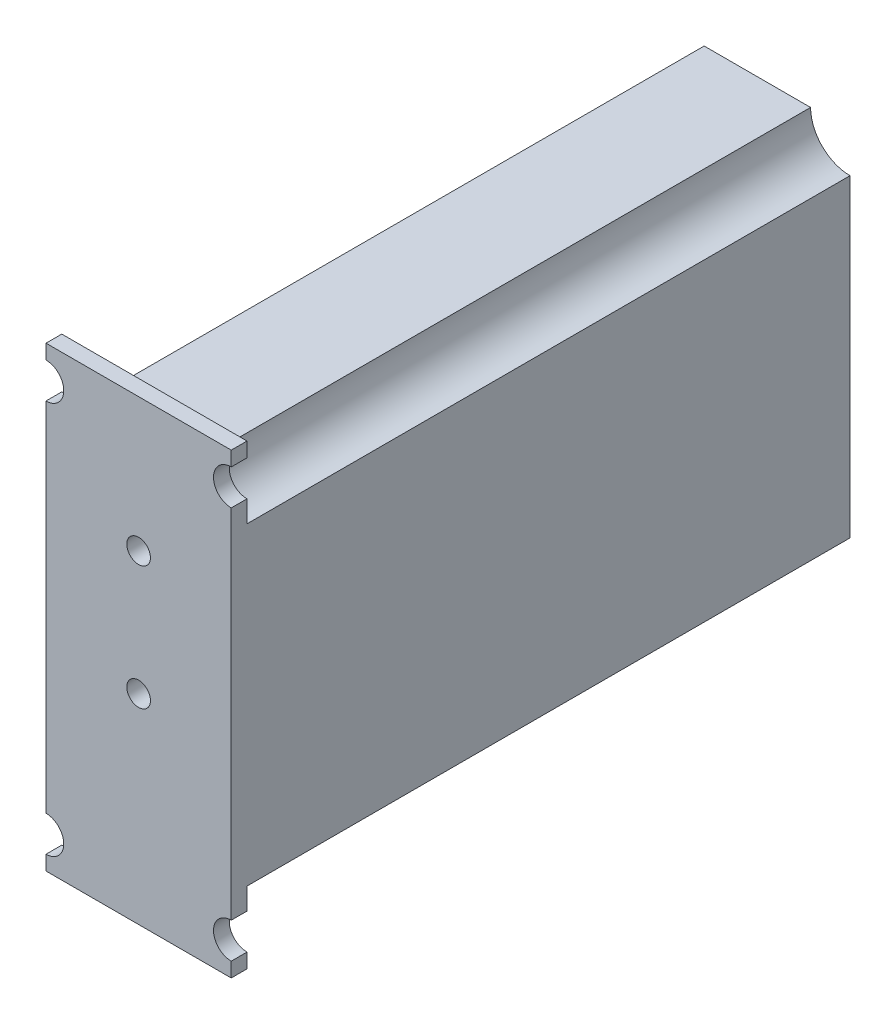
from build123d import *

# Parameters (mm, degrees)
SKETCH1_W          = 11.938
SKETCH1_H          = 25.2984
BODY_DEPTH         = 38.862
SKETCH3_R          = 2.54
CUT_EXTRUDE1_DEPTH = 42.302376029
SKETCH2_W          = 11.938
SKETCH2_H          = 29.464
BASE_DEPTH         = 1.016
SKETCH4_R          = 1.143
MOUNT_HOLES_DEPTH  = 7.62
SKETCH5_R          = 0.762
VALVE_HOLES_DEPTH  = 6.35


with BuildPart() as part:
    # Sketch1 → body (new body)
    with BuildSketch(Plane.XY):
        Rectangle(SKETCH1_W, SKETCH1_H)
    extrude(amount=BODY_DEPTH)

    # Sketch3 → Cut-Extrude1 (cut, through all)
    with BuildSketch(Plane(origin=(0, 0, 0), x_dir=(-1, 0, 0), z_dir=(0, 0, -1))):
        with Locations((-5.969, 12.6492)):
            Circle(SKETCH3_R)
        with Locations((5.969, 12.6492)):
            Circle(SKETCH3_R)
        with Locations((5.969, -12.6492)):
            Circle(SKETCH3_R)
        with Locations((-5.969, -12.6492)):
            Circle(SKETCH3_R)
    extrude(amount=-CUT_EXTRUDE1_DEPTH, mode=Mode.SUBTRACT)

    # Sketch2 → base (add)
    with BuildSketch(Plane.XY.offset(38.862)):
        Rectangle(SKETCH2_W, SKETCH2_H)
    extrude(amount=BASE_DEPTH)

    # Sketch4 → mount_holes (cut)
    with BuildSketch(Plane(origin=(0, 0, 38.862), x_dir=(-1, 0, 0), z_dir=(0, 0, -1))):
        with Locations((-5.969, 12.6492)):
            Circle(SKETCH4_R)
        with Locations((5.969, 12.6492)):
            Circle(SKETCH4_R)
        with Locations((-5.969, -12.6492)):
            Circle(SKETCH4_R)
        with Locations((5.969, -12.6492)):
            Circle(SKETCH4_R)
    extrude(amount=-MOUNT_HOLES_DEPTH, mode=Mode.SUBTRACT)

    # Sketch5 → valve_holes (cut)
    with BuildSketch(Plane.XY.offset(39.878)):
        with Locations((0, 6.1214)):
            Circle(SKETCH5_R)
        with Locations(Location((0, -1.8542, 0), (0, 0, 180))):
            Circle(SKETCH5_R)
    extrude(amount=-VALVE_HOLES_DEPTH, mode=Mode.SUBTRACT)


solid = part.part
